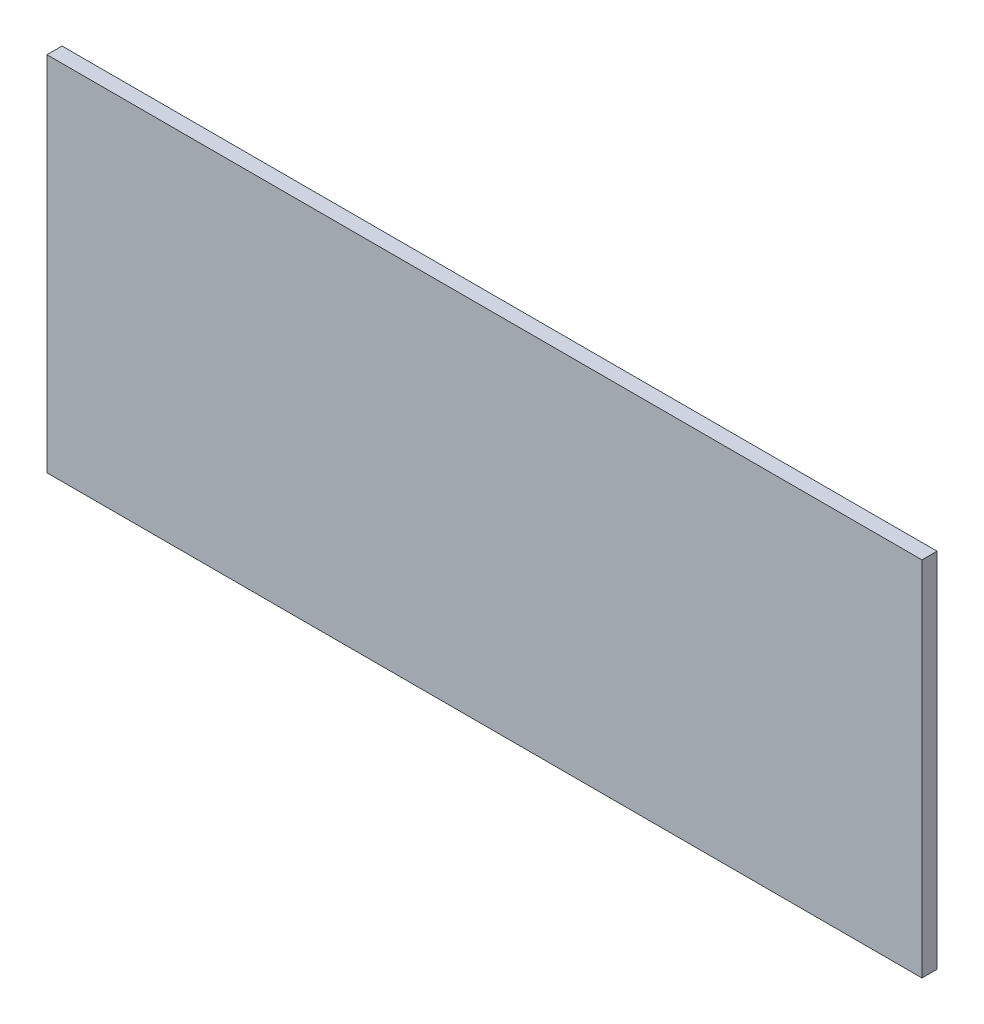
ISO-10303-21;
HEADER;
FILE_DESCRIPTION(('STEP AP214'),'2;1');
FILE_NAME('part.step','',(''),(''),'','','');
FILE_SCHEMA(('AUTOMOTIVE_DESIGN { 1 0 10303 214 1 1 1 1 }'));
ENDSEC;
DATA;
#1=APPLICATION_CONTEXT('core data for automotive mechanical design processes');
#2=APPLICATION_PROTOCOL_DEFINITION('international standard','automotive_design',2000,#1);
#3=PRODUCT_CONTEXT('',#1,'mechanical');
#4=PRODUCT('Part','Part','',(#3));
#5=PRODUCT_RELATED_PRODUCT_CATEGORY('part','',(#4));
#6=PRODUCT_DEFINITION_FORMATION('','',#4);
#7=PRODUCT_DEFINITION_CONTEXT('part definition',#1,'design');
#8=PRODUCT_DEFINITION('design','',#6,#7);
#9=PRODUCT_DEFINITION_SHAPE('','',#8);
#10=(LENGTH_UNIT() NAMED_UNIT(*) SI_UNIT(.MILLI.,.METRE.));
#11=(NAMED_UNIT(*) PLANE_ANGLE_UNIT() SI_UNIT($,.RADIAN.));
#12=(NAMED_UNIT(*) SI_UNIT($,.STERADIAN.) SOLID_ANGLE_UNIT());
#13=UNCERTAINTY_MEASURE_WITH_UNIT(LENGTH_MEASURE(1.E-05),#10,'distance_accuracy_value','');
#14=(GEOMETRIC_REPRESENTATION_CONTEXT(3) GLOBAL_UNCERTAINTY_ASSIGNED_CONTEXT((#13)) GLOBAL_UNIT_ASSIGNED_CONTEXT((#10,
#11,#12)) REPRESENTATION_CONTEXT('',''));
#15=CARTESIAN_POINT('',(0.,0.,0.));
#16=DIRECTION('',(0.,0.,1.));
#17=DIRECTION('',(1.,0.,0.));
#18=AXIS2_PLACEMENT_3D('',#15,#16,#17);
#19=CARTESIAN_POINT('',(0.,0.,19.05));
#20=DIRECTION('',(1.,0.,0.));
#21=DIRECTION('',(0.,0.,-1.));
#22=AXIS2_PLACEMENT_3D('',#19,#20,#21);
#23=PLANE('',#22);
#24=DIRECTION('',(0.,-1.,0.));
#25=VECTOR('',#24,1.);
#26=CARTESIAN_POINT('',(0.,0.,0.));
#27=LINE('',#26,#25);
#28=CARTESIAN_POINT('',(0.,457.2,0.));
#29=VERTEX_POINT('',#28);
#30=CARTESIAN_POINT('',(0.,0.,0.));
#31=VERTEX_POINT('',#30);
#32=EDGE_CURVE('E70',#29,#31,#27,.T.);
#33=ORIENTED_EDGE('',*,*,#32,.T.);
#34=DIRECTION('',(0.,0.,-1.));
#35=VECTOR('',#34,1.);
#36=CARTESIAN_POINT('',(0.,0.,19.05));
#37=LINE('',#36,#35);
#38=CARTESIAN_POINT('',(0.,0.,19.05));
#39=VERTEX_POINT('',#38);
#40=EDGE_CURVE('E11',#39,#31,#37,.T.);
#41=ORIENTED_EDGE('',*,*,#40,.F.);
#42=DIRECTION('',(0.,-1.,0.));
#43=VECTOR('',#42,1.);
#44=CARTESIAN_POINT('',(0.,0.,19.05));
#45=LINE('',#44,#43);
#46=CARTESIAN_POINT('',(0.,457.2,19.05));
#47=VERTEX_POINT('',#46);
#48=EDGE_CURVE('E88',#47,#39,#45,.T.);
#49=ORIENTED_EDGE('',*,*,#48,.F.);
#50=DIRECTION('',(0.,0.,-1.));
#51=VECTOR('',#50,1.);
#52=CARTESIAN_POINT('',(0.,457.2,19.05));
#53=LINE('',#52,#51);
#54=EDGE_CURVE('E82',#47,#29,#53,.T.);
#55=ORIENTED_EDGE('',*,*,#54,.T.);
#56=EDGE_LOOP('',(#33,#41,#49,#55));
#57=FACE_BOUND('',#56,.T.);
#58=ADVANCED_FACE('F26',(#57),#23,.F.);
#59=CARTESIAN_POINT('',(0.,0.,19.05));
#60=DIRECTION('',(0.,1.,0.));
#61=DIRECTION('',(0.,0.,1.));
#62=AXIS2_PLACEMENT_3D('',#59,#60,#61);
#63=PLANE('',#62);
#64=DIRECTION('',(1.,0.,0.));
#65=VECTOR('',#64,1.);
#66=CARTESIAN_POINT('',(0.,0.,0.));
#67=LINE('',#66,#65);
#68=CARTESIAN_POINT('',(1104.9,0.,0.));
#69=VERTEX_POINT('',#68);
#70=EDGE_CURVE('E66',#31,#69,#67,.T.);
#71=ORIENTED_EDGE('',*,*,#70,.T.);
#72=DIRECTION('',(0.,0.,-1.));
#73=VECTOR('',#72,1.);
#74=CARTESIAN_POINT('',(1104.9,0.,19.05));
#75=LINE('',#74,#73);
#76=CARTESIAN_POINT('',(1104.9,0.,19.05));
#77=VERTEX_POINT('',#76);
#78=EDGE_CURVE('E33',#77,#69,#75,.T.);
#79=ORIENTED_EDGE('',*,*,#78,.F.);
#80=DIRECTION('',(1.,0.,0.));
#81=VECTOR('',#80,1.);
#82=CARTESIAN_POINT('',(0.,0.,19.05));
#83=LINE('',#82,#81);
#84=EDGE_CURVE('E78',#39,#77,#83,.T.);
#85=ORIENTED_EDGE('',*,*,#84,.F.);
#86=ORIENTED_EDGE('',*,*,#40,.T.);
#87=EDGE_LOOP('',(#71,#79,#85,#86));
#88=FACE_BOUND('',#87,.T.);
#89=ADVANCED_FACE('F77',(#88),#63,.F.);
#90=CARTESIAN_POINT('',(1104.9,0.,19.05));
#91=DIRECTION('',(-1.,0.,0.));
#92=DIRECTION('',(0.,0.,1.));
#93=AXIS2_PLACEMENT_3D('',#90,#91,#92);
#94=PLANE('',#93);
#95=DIRECTION('',(0.,1.,0.));
#96=VECTOR('',#95,1.);
#97=CARTESIAN_POINT('',(1104.9,0.,0.));
#98=LINE('',#97,#96);
#99=CARTESIAN_POINT('',(1104.9,457.2,0.));
#100=VERTEX_POINT('',#99);
#101=EDGE_CURVE('E71',#69,#100,#98,.T.);
#102=ORIENTED_EDGE('',*,*,#101,.T.);
#103=DIRECTION('',(0.,0.,-1.));
#104=VECTOR('',#103,1.);
#105=CARTESIAN_POINT('',(1104.9,457.2,19.05));
#106=LINE('',#105,#104);
#107=CARTESIAN_POINT('',(1104.9,457.2,19.05));
#108=VERTEX_POINT('',#107);
#109=EDGE_CURVE('E94',#108,#100,#106,.T.);
#110=ORIENTED_EDGE('',*,*,#109,.F.);
#111=DIRECTION('',(0.,1.,0.));
#112=VECTOR('',#111,1.);
#113=CARTESIAN_POINT('',(1104.9,0.,19.05));
#114=LINE('',#113,#112);
#115=EDGE_CURVE('E45',#77,#108,#114,.T.);
#116=ORIENTED_EDGE('',*,*,#115,.F.);
#117=ORIENTED_EDGE('',*,*,#78,.T.);
#118=EDGE_LOOP('',(#102,#110,#116,#117));
#119=FACE_BOUND('',#118,.T.);
#120=ADVANCED_FACE('F97',(#119),#94,.F.);
#121=CARTESIAN_POINT('',(0.,457.2,19.05));
#122=DIRECTION('',(0.,-1.,0.));
#123=DIRECTION('',(0.,0.,-1.));
#124=AXIS2_PLACEMENT_3D('',#121,#122,#123);
#125=PLANE('',#124);
#126=DIRECTION('',(-1.,0.,0.));
#127=VECTOR('',#126,1.);
#128=CARTESIAN_POINT('',(0.,457.2,0.));
#129=LINE('',#128,#127);
#130=EDGE_CURVE('E86',#100,#29,#129,.T.);
#131=ORIENTED_EDGE('',*,*,#130,.T.);
#132=ORIENTED_EDGE('',*,*,#54,.F.);
#133=DIRECTION('',(-1.,0.,0.));
#134=VECTOR('',#133,1.);
#135=CARTESIAN_POINT('',(0.,457.2,19.05));
#136=LINE('',#135,#134);
#137=EDGE_CURVE('E40',#108,#47,#136,.T.);
#138=ORIENTED_EDGE('',*,*,#137,.F.);
#139=ORIENTED_EDGE('',*,*,#109,.T.);
#140=EDGE_LOOP('',(#131,#132,#138,#139));
#141=FACE_BOUND('',#140,.T.);
#142=ADVANCED_FACE('F99',(#141),#125,.F.);
#143=CARTESIAN_POINT('',(0.,457.2,19.05));
#144=DIRECTION('',(0.,0.,-1.));
#145=DIRECTION('',(-1.,0.,0.));
#146=AXIS2_PLACEMENT_3D('',#143,#144,#145);
#147=PLANE('',#146);
#148=ORIENTED_EDGE('',*,*,#48,.T.);
#149=ORIENTED_EDGE('',*,*,#84,.T.);
#150=ORIENTED_EDGE('',*,*,#115,.T.);
#151=ORIENTED_EDGE('',*,*,#137,.T.);
#152=EDGE_LOOP('',(#148,#149,#150,#151));
#153=FACE_BOUND('',#152,.T.);
#154=ADVANCED_FACE('F100',(#153),#147,.F.);
#155=CARTESIAN_POINT('',(0.,457.2,0.));
#156=DIRECTION('',(0.,0.,-1.));
#157=DIRECTION('',(-1.,0.,0.));
#158=AXIS2_PLACEMENT_3D('',#155,#156,#157);
#159=PLANE('',#158);
#160=ORIENTED_EDGE('',*,*,#32,.F.);
#161=ORIENTED_EDGE('',*,*,#130,.F.);
#162=ORIENTED_EDGE('',*,*,#101,.F.);
#163=ORIENTED_EDGE('',*,*,#70,.F.);
#164=EDGE_LOOP('',(#160,#161,#162,#163));
#165=FACE_BOUND('',#164,.T.);
#166=ADVANCED_FACE('F67',(#165),#159,.T.);
#167=CLOSED_SHELL('',(#58,#89,#120,#142,#154,#166));
#168=MANIFOLD_SOLID_BREP('B2',#167);
#169=ADVANCED_BREP_SHAPE_REPRESENTATION('',(#18,#168),#14);
#170=SHAPE_DEFINITION_REPRESENTATION(#9,#169);
ENDSEC;
END-ISO-10303-21;
